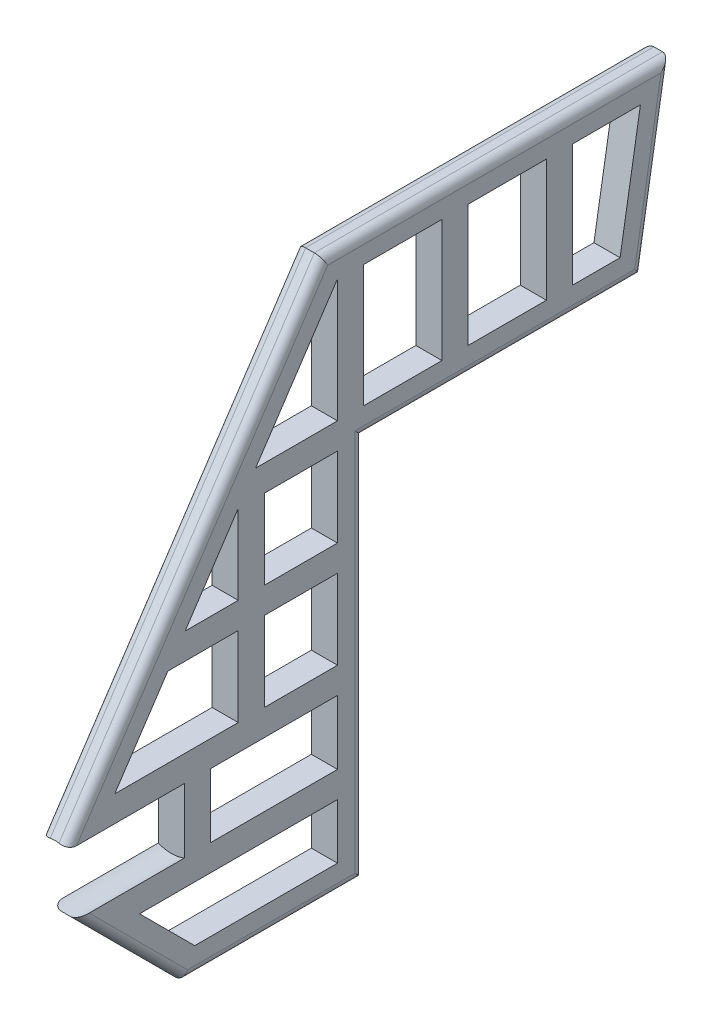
from build123d import *

# Parameters (mm, degrees)
BOSS_EXTRUDE1_DEPTH     = 4.7625
CUT_EXTRUDE1_DEPTH      = 117.218554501
CUT_EXTRUDE1_DEPTH_BACK = 117.218554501
SKETCH3_R               = 6.35
CUT_EXTRUDE2_DEPTH      = 136.059927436
SKETCH4_W               = 4.7625
SKETCH4_H               = 4.7625
BOSS_EXTRUDE2_DEPTH     = 22.294310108
SKETCH5_W               = 4.7625
SKETCH5_H               = 4.7625
BOSS_EXTRUDE3_DEPTH     = 23.152913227
BOSS_EXTRUDE4_REACH     = 120.591
SKETCH6_W               = 4.7625
SKETCH6_H               = 4.7625
BOSS_EXTRUDE5_REACH     = 91.717
SKETCH7_W               = 4.7625
SKETCH7_H               = 4.7625
FILLET1_R               = 1.5875


with BuildPart() as part:
    # Sketch1 → Boss-Extrude1 (new body)
    with BuildSketch(Plane(origin=(0, 0, 0), x_dir=(0, 0, -1), z_dir=(1, 0, 0))):
        Polygon((0, 0), (-32.766, 0), (-52.342958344, 19.576958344), (-32.677913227, 19.576958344), (-32.677913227, 31.260958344), (-54.267913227, 31.260958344), (-7.398107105, 101.669310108), (56.101892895, 101.669310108), (50.8, 69.85), (0, 69.85), align=None)
    extrude(amount=BOSS_EXTRUDE1_DEPTH)

    # Sketch2 → Cut-Extrude1 (cut, two sides: drawn at the far end of the back side and taken through both)
    with BuildSketch(Plane(origin=(4.7625, 0, 0), x_dir=(0, 0, -1), z_dir=(1, 0, 0)).offset(-CUT_EXTRUDE1_DEPTH_BACK)):
        Polygon((-30.793307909, 4.7625), (-4.7625, 4.7625), (-4.7625, 74.6125), (46.765391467, 74.6125), (50.480181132, 96.906810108), (-4.847211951, 96.906810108), (-45.376365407, 36.023458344), (-27.915413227, 36.023458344), (-27.915413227, 14.814458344), (-40.845266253, 14.814458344), align=None)
    extrude(amount=CUT_EXTRUDE1_DEPTH + CUT_EXTRUDE1_DEPTH_BACK, mode=Mode.SUBTRACT)

    # Sketch3 → Cut-Extrude2 (cut, through all)
    with BuildSketch(Plane.XY.offset(32.677913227)):
        with Locations((2.38125, 25.418958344)):
            Circle(SKETCH3_R)
    extrude(amount=CUT_EXTRUDE2_DEPTH, mode=Mode.SUBTRACT)

    # Sketch4 → Boss-Extrude2 (add)
    with BuildSketch(Plane(origin=(0, 74.6125, 0), x_dir=(1, 0, 0), z_dir=(0, 1, 0))):
        with Locations((2.38125, -2.38125)):
            Rectangle(SKETCH4_W, SKETCH4_H)
        with Locations((2.38125, 16.66875)):
            Rectangle(SKETCH4_W, SKETCH4_H)
        with Locations((2.38125, 35.71875)):
            Rectangle(SKETCH4_W, SKETCH4_H)
    extrude(amount=BOSS_EXTRUDE2_DEPTH)

    # Sketch5 → Boss-Extrude3 (add)
    with BuildSketch(Plane(origin=(0, 0, 27.915413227), x_dir=(-1, 0, 0), z_dir=(0, 0, -1))):
        with Locations((-2.38125, 33.642208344)):
            Rectangle(SKETCH5_W, SKETCH5_H)
        with Locations((-2.38125, 17.195708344)):
            Rectangle(SKETCH5_W, SKETCH5_H)
    extrude(amount=BOSS_EXTRUDE3_DEPTH)

    # Boss-Extrude4: up to this plane
    boss_extrude4_end = Plane(origin=(0, 96.906810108, 4.847211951), z_dir=(0, 0.5541345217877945, 0.832427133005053))
    # Sketch6 → Boss-Extrude4 (add, up to the surface)
    with BuildSketch(Plane.XY.offset(4.7625), mode=Mode.PRIVATE) as boss_extrude4_sk1:
        with Locations((2.38125, 72.23125)):
            Rectangle(SKETCH6_W, SKETCH6_H)
    boss_extrude4_tool1 = split(extrude(boss_extrude4_sk1.sketch, amount=BOSS_EXTRUDE4_REACH, mode=Mode.PRIVATE), bisect_by=boss_extrude4_end, keep=Keep.BOTH, mode=Mode.PRIVATE)
    add(boss_extrude4_tool1.solids().sort_by_distance((2.38125, 72.23125, 4.7625))[0])
    # Sketch6 → Boss-Extrude4 (add, up to the surface)
    with BuildSketch(Plane.XY.offset(4.7625), mode=Mode.PRIVATE) as boss_extrude4_sk2:
        with Locations((2.38125, 52.936729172)):
            Rectangle(SKETCH6_W, SKETCH6_H)
    boss_extrude4_tool2 = split(extrude(boss_extrude4_sk2.sketch, amount=BOSS_EXTRUDE4_REACH, mode=Mode.PRIVATE), bisect_by=boss_extrude4_end, keep=Keep.BOTH, mode=Mode.PRIVATE)
    add(boss_extrude4_tool2.solids().sort_by_distance((2.38125, 52.936729, 4.7625))[0])

    # Boss-Extrude5: up to this face of the body (flat: up to its plane)
    boss_extrude5_end = Plane(part.part.faces().sort_by_distance((2.38125, 36.023458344, 25.069432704))[0])
    # Sketch7 → Boss-Extrude5 (add, up to the picked face)
    with BuildSketch(Plane.XZ.offset(-69.85), mode=Mode.PRIVATE) as boss_extrude5_sk1:
        with Locations((2.38125, 20.477283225)):
            Rectangle(SKETCH7_W, SKETCH7_H)
    boss_extrude5_tool1 = split(extrude(boss_extrude5_sk1.sketch, amount=BOSS_EXTRUDE5_REACH, mode=Mode.PRIVATE), bisect_by=boss_extrude5_end, keep=Keep.BOTH, mode=Mode.PRIVATE)
    add(boss_extrude5_tool1.solids().sort_by(Axis((2.38125, 69.85, 20.477283), (0, -1, 0)))[0])

    # Fillet1
    fillet1_edges = [part.edges().sort_by_distance(p)[0] for p in [
        (0, 9.766175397, 42.532175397),
        (0, 85.759655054, -53.450946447),
        (0, 69.85, -25.4),
        (0, 34.925, 0),
        (0, 0, 16.383),
        (0, 66.487438, 30.818162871),
        (0, 101.669310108, -24.351892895),
        (4.7625, 9.766175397, 42.532175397),
        (4.7625, 0, 16.383),
        (4.7625, 34.925, 0),
        (4.7625, 69.85, -25.4),
        (4.7625, 85.759655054, -53.450946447),
        (4.7625, 101.669310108, -24.351892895),
        (4.7625, 66.487438, 30.818162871),
    ]]
    fillet(fillet1_edges, radius=FILLET1_R)


solid = part.part
